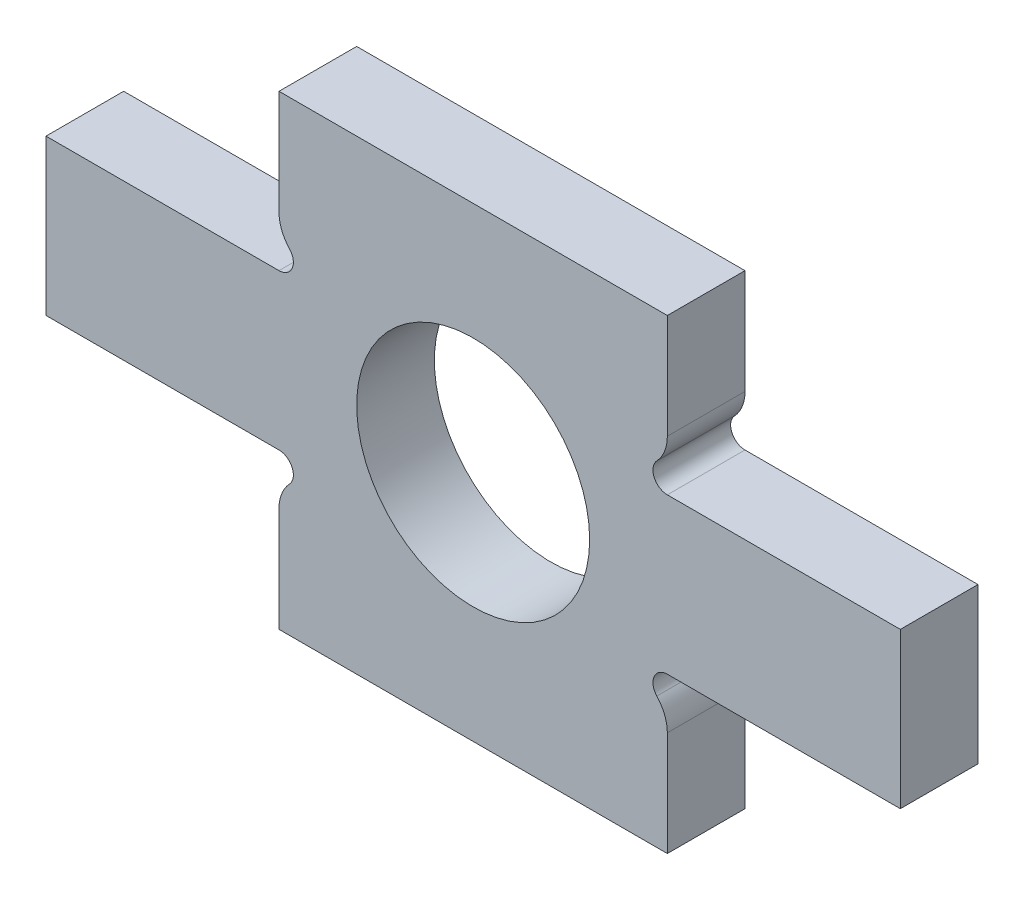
from build123d import *

# Parameters (mm, degrees)
BOSS_EXTRU_1_DEPTH      = 10
ESQUISSE3_R             = 15
ENL_V_MAT_EXTRU_1_DEPTH = 64.442887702


with BuildPart() as part:
    # Esquisse1 → Boss.-Extru.1 (new body)
    with BuildSketch(Plane.XY):
        with BuildLine():
            Line((25, -10), (55, -10))
            Line((55, -10), (55, 10))
            Line((55, 10), (25, 10))
            ThreePointArc((25, 10), (23.302669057, 11.114087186), (23.649635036, 13.114521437))
            ThreePointArc((23.649635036, 13.114521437), (24.650170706, 14.694781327), (25, 16.532146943))
            Line((25, 16.532146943), (25, 30))
            Line((25, 30), (-25, 30))
            Line((-25, 30), (-25, 16.532146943))
            ThreePointArc((-25, 16.532146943), (-24.650170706, 14.694781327), (-23.649635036, 13.114521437))
            ThreePointArc((-23.649635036, 13.114521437), (-23.302669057, 11.114087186), (-25, 10))
            Line((-25, 10), (-55, 10))
            Line((-55, 10), (-55, -10))
            Line((-55, -10), (-25, -10))
            ThreePointArc((-25, -10), (-23.302669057, -11.114087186), (-23.649635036, -13.114521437))
            ThreePointArc((-23.649635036, -13.114521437), (-24.650170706, -14.694781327), (-25, -16.532146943))
            Line((-25, -16.532146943), (-25, -30))
            Line((-25, -30), (25, -30))
            Line((25, -30), (25, -16.532146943))
            ThreePointArc((25, -16.532146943), (24.650170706, -14.694781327), (23.649635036, -13.114521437))
            ThreePointArc((23.649635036, -13.114521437), (23.302669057, -11.114087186), (25, -10))
        make_face()
    extrude(amount=BOSS_EXTRU_1_DEPTH)

    # Esquisse3 → Enl_v. mat.-Extru.1 (cut, through all)
    with BuildSketch(Plane.XY.offset(10)):
        Circle(ESQUISSE3_R)
    extrude(amount=-ENL_V_MAT_EXTRU_1_DEPTH, mode=Mode.SUBTRACT)


solid = part.part
